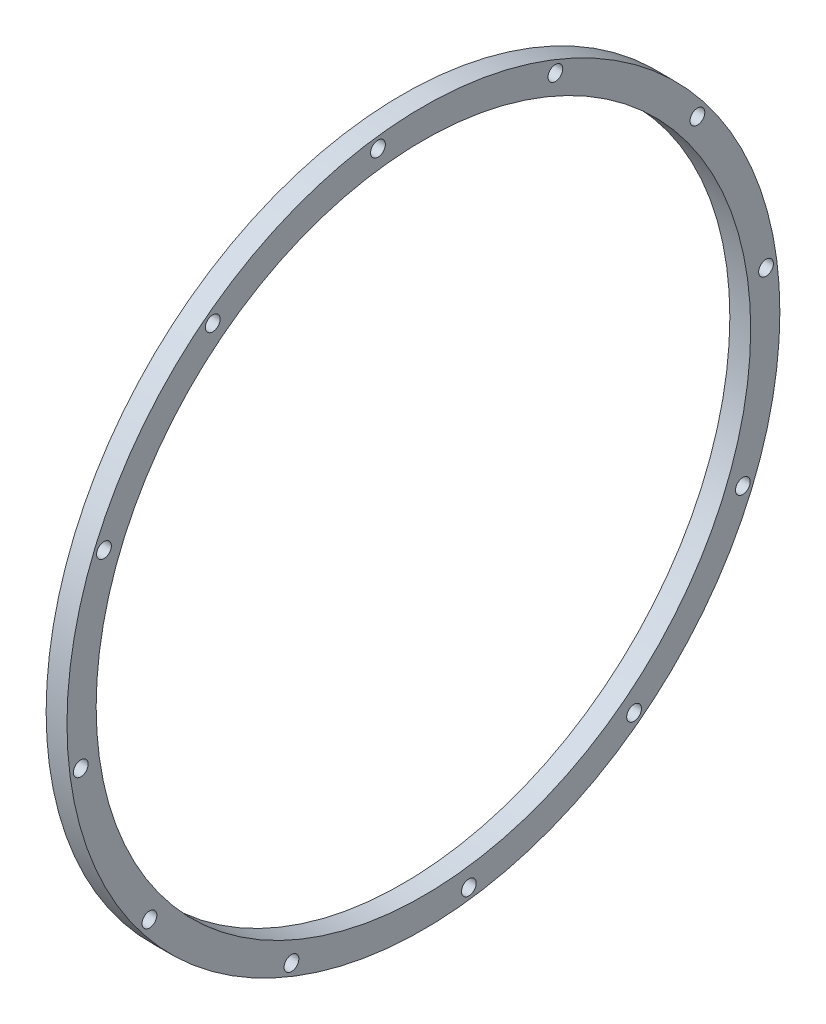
from build123d import *

# Parameters (mm, degrees)
SKETCH1_R             = 108.585
BOSS_EXTRUDE1_DEPTH   = 6.35
SKETCH2_R             = 99.695
CUT_EXTRUDE1_DEPTH    = 6.35
F_8_CLEARANCE_HOLE1_D = 4.4958
CIRPATTERN1_COUNT     = 12


with BuildPart() as part:
    # Sketch1 → Boss-Extrude1 (new body)
    with BuildSketch(Plane(origin=(0, 0, 0), x_dir=(0, 0, -1), z_dir=(1, 0, 0))):
        Circle(SKETCH1_R)
    extrude(amount=BOSS_EXTRUDE1_DEPTH)

    # Sketch2 → Cut-Extrude1 (cut)
    with BuildSketch(Plane(origin=(6.35, 0, 0), x_dir=(0, 0, -1), z_dir=(1, 0, 0))):
        Circle(SKETCH2_R)
    extrude(amount=-CUT_EXTRUDE1_DEPTH, mode=Mode.SUBTRACT)

    # 8 Clearance Hole1 (through all)
    with Locations(Plane(origin=(6.35, 0, 0), x_dir=(0, 0, -1), z_dir=(1, 0, 0))):
        with Locations((40.197626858, 97.30704437)):
            f_8_clearance_hole1 = Hole(F_8_CLEARANCE_HOLE1_D / 2)

    # CirPattern1: 8 Clearance Hole1 ×12 about axis
    cirpattern1_axis = Axis((0, 0, 0), (1, 0, 0))
    for i in range(1, CIRPATTERN1_COUNT):
        add(f_8_clearance_hole1.rotate(cirpattern1_axis, i * 360 / CIRPATTERN1_COUNT), mode=Mode.SUBTRACT)


solid = part.part
